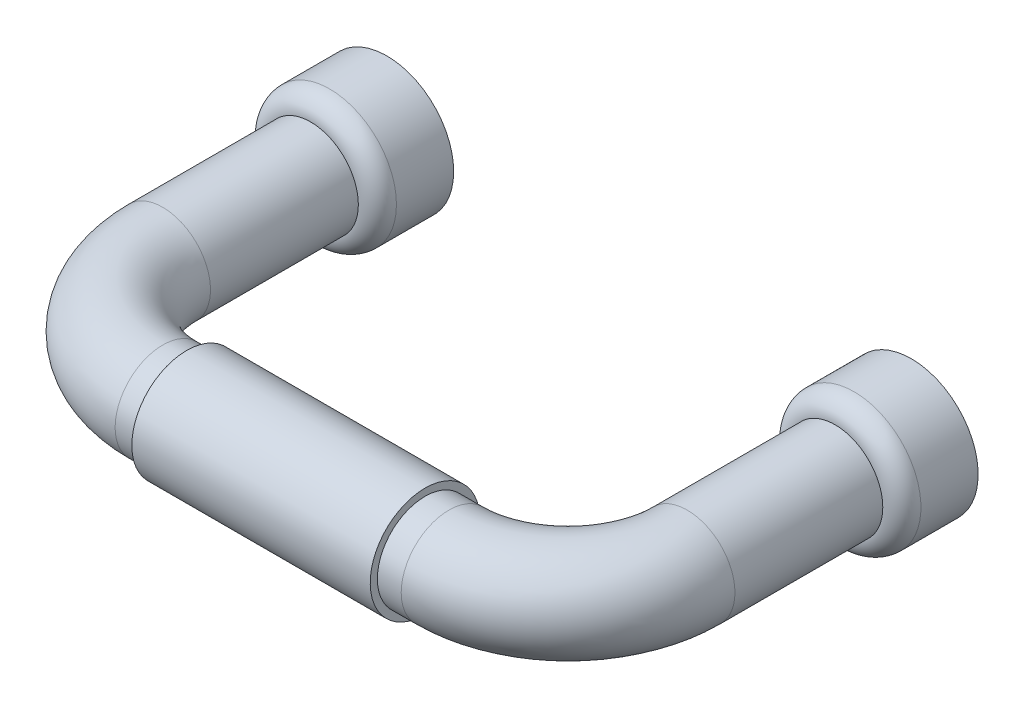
ISO-10303-21;
HEADER;
FILE_DESCRIPTION(('STEP AP214'),'2;1');
FILE_NAME('part.step','',(''),(''),'','','');
FILE_SCHEMA(('AUTOMOTIVE_DESIGN { 1 0 10303 214 1 1 1 1 }'));
ENDSEC;
DATA;
#1=APPLICATION_CONTEXT('core data for automotive mechanical design processes');
#2=APPLICATION_PROTOCOL_DEFINITION('international standard','automotive_design',2000,#1);
#3=PRODUCT_CONTEXT('',#1,'mechanical');
#4=PRODUCT('Part','Part','',(#3));
#5=PRODUCT_RELATED_PRODUCT_CATEGORY('part','',(#4));
#6=PRODUCT_DEFINITION_FORMATION('','',#4);
#7=PRODUCT_DEFINITION_CONTEXT('part definition',#1,'design');
#8=PRODUCT_DEFINITION('design','',#6,#7);
#9=PRODUCT_DEFINITION_SHAPE('','',#8);
#10=(LENGTH_UNIT() NAMED_UNIT(*) SI_UNIT(.MILLI.,.METRE.));
#11=(NAMED_UNIT(*) PLANE_ANGLE_UNIT() SI_UNIT($,.RADIAN.));
#12=(NAMED_UNIT(*) SI_UNIT($,.STERADIAN.) SOLID_ANGLE_UNIT());
#13=UNCERTAINTY_MEASURE_WITH_UNIT(LENGTH_MEASURE(1.E-05),#10,'distance_accuracy_value','');
#14=(GEOMETRIC_REPRESENTATION_CONTEXT(3) GLOBAL_UNCERTAINTY_ASSIGNED_CONTEXT((#13)) GLOBAL_UNIT_ASSIGNED_CONTEXT((#10,
#11,#12)) REPRESENTATION_CONTEXT('',''));
#15=CARTESIAN_POINT('',(0.,0.,0.));
#16=DIRECTION('',(0.,0.,1.));
#17=DIRECTION('',(1.,0.,0.));
#18=AXIS2_PLACEMENT_3D('',#15,#16,#17);
#19=CARTESIAN_POINT('',(-3.15719672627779E-13,0.,7.86972348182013E-13));
#20=DIRECTION('',(0.,0.,-1.));
#21=DIRECTION('',(0.,1.,0.));
#22=AXIS2_PLACEMENT_3D('',#19,#20,#21);
#23=PLANE('',#22);
#24=CARTESIAN_POINT('',(-3.15719672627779E-13,0.,8.15627124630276E-13));
#25=DIRECTION('',(0.,0.,1.));
#26=DIRECTION('',(1.,0.,0.));
#27=AXIS2_PLACEMENT_3D('',#24,#25,#26);
#28=CIRCLE('',#27,7.00045758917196);
#29=CARTESIAN_POINT('',(7.00045758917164,0.,7.88874925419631E-13));
#30=VERTEX_POINT('',#29);
#31=EDGE_CURVE('E295',#30,#30,#28,.T.);
#32=ORIENTED_EDGE('',*,*,#31,.F.);
#33=EDGE_LOOP('',(#32));
#34=FACE_BOUND('',#33,.T.);
#35=CARTESIAN_POINT('',(-3.15719672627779E-13,0.,7.90441795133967E-13));
#36=DIRECTION('',(0.,0.,1.));
#37=DIRECTION('',(0.,-1.,0.));
#38=AXIS2_PLACEMENT_3D('',#35,#36,#37);
#39=CIRCLE('',#38,2.5);
#40=CARTESIAN_POINT('',(-3.15719672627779E-13,-2.5,7.90441795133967E-13));
#41=VERTEX_POINT('',#40);
#42=EDGE_CURVE('E285',#41,#41,#39,.T.);
#43=ORIENTED_EDGE('',*,*,#42,.T.);
#44=EDGE_LOOP('',(#43));
#45=FACE_BOUND('',#44,.T.);
#46=ADVANCED_FACE('F12',(#34,#45),#23,.T.);
#47=CARTESIAN_POINT('',(42.5,0.,36.0000000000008));
#48=DIRECTION('',(-1.,0.,0.));
#49=DIRECTION('',(0.,-1.,0.));
#50=AXIS2_PLACEMENT_3D('',#47,#48,#49);
#51=CYLINDRICAL_SURFACE('',#50,5.);
#52=CARTESIAN_POINT('',(40.,0.,36.0000000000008));
#53=DIRECTION('',(1.,0.,0.));
#54=DIRECTION('',(0.,1.,0.));
#55=AXIS2_PLACEMENT_3D('',#52,#53,#54);
#56=CIRCLE('',#55,5.);
#57=CARTESIAN_POINT('',(40.,5.,36.0000000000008));
#58=VERTEX_POINT('',#57);
#59=EDGE_CURVE('E19',#58,#58,#56,.F.);
#60=ORIENTED_EDGE('',*,*,#59,.F.);
#61=EDGE_LOOP('',(#60));
#62=FACE_BOUND('',#61,.T.);
#63=CARTESIAN_POINT('',(42.5,0.,36.0000000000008));
#64=DIRECTION('',(-1.,0.,0.));
#65=DIRECTION('',(0.,1.,0.));
#66=AXIS2_PLACEMENT_3D('',#63,#64,#65);
#67=CIRCLE('',#66,5.);
#68=CARTESIAN_POINT('',(42.5,0.,41.0000000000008));
#69=VERTEX_POINT('',#68);
#70=EDGE_CURVE('E55',#69,#69,#67,.T.);
#71=ORIENTED_EDGE('',*,*,#70,.T.);
#72=EDGE_LOOP('',(#71));
#73=FACE_BOUND('',#72,.T.);
#74=ADVANCED_FACE('F77',(#62,#73),#51,.T.);
#75=CARTESIAN_POINT('',(42.5,0.,23.5000000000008));
#76=DIRECTION('',(0.,-1.,0.));
#77=DIRECTION('',(1.,0.,0.));
#78=AXIS2_PLACEMENT_3D('',#75,#76,#77);
#79=TOROIDAL_SURFACE('',#78,12.5,5.);
#80=CARTESIAN_POINT('',(55.,0.,23.5000000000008));
#81=DIRECTION('',(0.,0.,1.));
#82=DIRECTION('',(0.,1.,0.));
#83=AXIS2_PLACEMENT_3D('',#80,#81,#82);
#84=CIRCLE('',#83,5.);
#85=CARTESIAN_POINT('',(60.,0.,23.5000000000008));
#86=VERTEX_POINT('',#85);
#87=EDGE_CURVE('E52',#86,#86,#84,.T.);
#88=CARTESIAN_POINT('',(42.5,0.,23.5000000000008));
#89=DIRECTION('',(0.,-1.,0.));
#90=DIRECTION('',(1.,0.,0.));
#91=AXIS2_PLACEMENT_3D('',#88,#89,#90);
#92=CIRCLE('',#91,17.5);
#93=EDGE_CURVE('',#86,#69,#92,.T.);
#94=ORIENTED_EDGE('',*,*,#87,.T.);
#95=ORIENTED_EDGE('',*,*,#70,.F.);
#96=ORIENTED_EDGE('',*,*,#93,.T.);
#97=ORIENTED_EDGE('',*,*,#93,.F.);
#98=EDGE_LOOP('',(#94,#96,#95,#97));
#99=FACE_BOUND('',#98,.T.);
#100=ADVANCED_FACE('F87',(#99),#79,.T.);
#101=CARTESIAN_POINT('',(55.,0.,23.5000000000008));
#102=DIRECTION('',(0.,0.,-1.));
#103=DIRECTION('',(0.,-1.,0.));
#104=AXIS2_PLACEMENT_3D('',#101,#102,#103);
#105=CYLINDRICAL_SURFACE('',#104,5.);
#106=CARTESIAN_POINT('',(55.,0.,7.99921137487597));
#107=DIRECTION('',(0.,0.,1.));
#108=DIRECTION('',(1.,0.,0.));
#109=AXIS2_PLACEMENT_3D('',#106,#107,#108);
#110=CIRCLE('',#109,5.);
#111=CARTESIAN_POINT('',(60.,0.,7.99921137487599));
#112=VERTEX_POINT('',#111);
#113=EDGE_CURVE('E31',#112,#112,#110,.T.);
#114=ORIENTED_EDGE('',*,*,#113,.T.);
#115=EDGE_LOOP('',(#114));
#116=FACE_BOUND('',#115,.T.);
#117=ORIENTED_EDGE('',*,*,#87,.F.);
#118=EDGE_LOOP('',(#117));
#119=FACE_BOUND('',#118,.T.);
#120=ADVANCED_FACE('F95',(#116,#119),#105,.T.);
#121=CARTESIAN_POINT('',(40.,0.,36.0000000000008));
#122=DIRECTION('',(1.,0.,0.));
#123=DIRECTION('',(0.,1.,0.));
#124=AXIS2_PLACEMENT_3D('',#121,#122,#123);
#125=PLANE('',#124);
#126=ORIENTED_EDGE('',*,*,#59,.T.);
#127=EDGE_LOOP('',(#126));
#128=FACE_BOUND('',#127,.T.);
#129=CARTESIAN_POINT('',(40.,0.,36.0000000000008));
#130=DIRECTION('',(1.,0.,0.));
#131=DIRECTION('',(0.,1.,0.));
#132=AXIS2_PLACEMENT_3D('',#129,#130,#131);
#133=CIRCLE('',#132,5.75);
#134=CARTESIAN_POINT('',(40.,5.75,36.0000000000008));
#135=VERTEX_POINT('',#134);
#136=EDGE_CURVE('E33',#135,#135,#133,.T.);
#137=ORIENTED_EDGE('',*,*,#136,.T.);
#138=EDGE_LOOP('',(#137));
#139=FACE_BOUND('',#138,.T.);
#140=ADVANCED_FACE('F98',(#128,#139),#125,.T.);
#141=CARTESIAN_POINT('',(14.9999999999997,0.,41.7500000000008));
#142=DIRECTION('',(-1.,0.,0.));
#143=DIRECTION('',(0.,-1.,0.));
#144=AXIS2_PLACEMENT_3D('',#141,#142,#143);
#145=PLANE('',#144);
#146=CARTESIAN_POINT('',(14.9999999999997,0.,36.0000000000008));
#147=DIRECTION('',(-1.,0.,0.));
#148=DIRECTION('',(0.,-1.,0.));
#149=AXIS2_PLACEMENT_3D('',#146,#147,#148);
#150=CIRCLE('',#149,5.);
#151=CARTESIAN_POINT('',(14.9999999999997,-5.,36.0000000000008));
#152=VERTEX_POINT('',#151);
#153=EDGE_CURVE('E23',#152,#152,#150,.F.);
#154=ORIENTED_EDGE('',*,*,#153,.T.);
#155=EDGE_LOOP('',(#154));
#156=FACE_BOUND('',#155,.T.);
#157=CARTESIAN_POINT('',(14.9999999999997,0.,36.0000000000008));
#158=DIRECTION('',(1.,0.,0.));
#159=DIRECTION('',(0.,1.,0.));
#160=AXIS2_PLACEMENT_3D('',#157,#158,#159);
#161=CIRCLE('',#160,5.75);
#162=CARTESIAN_POINT('',(14.9999999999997,5.75,36.0000000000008));
#163=VERTEX_POINT('',#162);
#164=EDGE_CURVE('E38',#163,#163,#161,.T.);
#165=ORIENTED_EDGE('',*,*,#164,.F.);
#166=EDGE_LOOP('',(#165));
#167=FACE_BOUND('',#166,.T.);
#168=ADVANCED_FACE('F127',(#156,#167),#145,.T.);
#169=CARTESIAN_POINT('',(43.3852693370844,0.,36.0000000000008));
#170=DIRECTION('',(1.,0.,0.));
#171=DIRECTION('',(0.,1.,0.));
#172=AXIS2_PLACEMENT_3D('',#169,#170,#171);
#173=CYLINDRICAL_SURFACE('',#172,5.75);
#174=ORIENTED_EDGE('',*,*,#136,.F.);
#175=EDGE_LOOP('',(#174));
#176=FACE_BOUND('',#175,.T.);
#177=ORIENTED_EDGE('',*,*,#164,.T.);
#178=EDGE_LOOP('',(#177));
#179=FACE_BOUND('',#178,.T.);
#180=ADVANCED_FACE('F78',(#176,#179),#173,.T.);
#181=CARTESIAN_POINT('',(-3.08780778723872E-13,0.,23.5000000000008));
#182=DIRECTION('',(0.,0.,-1.));
#183=DIRECTION('',(-1.,0.,0.));
#184=AXIS2_PLACEMENT_3D('',#181,#182,#183);
#185=CYLINDRICAL_SURFACE('',#184,5.);
#186=CARTESIAN_POINT('',(-3.12250225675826E-13,0.,7.99921137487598));
#187=DIRECTION('',(0.,0.,1.));
#188=DIRECTION('',(1.,0.,0.));
#189=AXIS2_PLACEMENT_3D('',#186,#187,#188);
#190=CIRCLE('',#189,5.);
#191=CARTESIAN_POINT('',(4.99999999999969,0.,7.99921137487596));
#192=VERTEX_POINT('',#191);
#193=EDGE_CURVE('E8',#192,#192,#190,.F.);
#194=ORIENTED_EDGE('',*,*,#193,.F.);
#195=EDGE_LOOP('',(#194));
#196=FACE_BOUND('',#195,.T.);
#197=CARTESIAN_POINT('',(-3.08780778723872E-13,0.,23.5000000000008));
#198=DIRECTION('',(0.,0.,-1.));
#199=DIRECTION('',(0.,1.,0.));
#200=AXIS2_PLACEMENT_3D('',#197,#198,#199);
#201=CIRCLE('',#200,5.);
#202=CARTESIAN_POINT('',(-5.0000000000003,0.,23.5000000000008));
#203=VERTEX_POINT('',#202);
#204=EDGE_CURVE('E28',#203,#203,#201,.T.);
#205=ORIENTED_EDGE('',*,*,#204,.T.);
#206=EDGE_LOOP('',(#205));
#207=FACE_BOUND('',#206,.T.);
#208=ADVANCED_FACE('F14',(#196,#207),#185,.T.);
#209=CARTESIAN_POINT('',(12.4999999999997,0.,23.5000000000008));
#210=DIRECTION('',(0.,-1.,0.));
#211=DIRECTION('',(1.,0.,0.));
#212=AXIS2_PLACEMENT_3D('',#209,#210,#211);
#213=TOROIDAL_SURFACE('',#212,12.5,5.);
#214=CARTESIAN_POINT('',(12.4999999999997,0.,36.0000000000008));
#215=DIRECTION('',(-1.,0.,0.));
#216=DIRECTION('',(0.,1.,0.));
#217=AXIS2_PLACEMENT_3D('',#214,#215,#216);
#218=CIRCLE('',#217,5.);
#219=CARTESIAN_POINT('',(12.4999999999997,0.,41.0000000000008));
#220=VERTEX_POINT('',#219);
#221=EDGE_CURVE('E58',#220,#220,#218,.T.);
#222=CARTESIAN_POINT('',(12.4999999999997,0.,23.5000000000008));
#223=DIRECTION('',(0.,-1.,0.));
#224=DIRECTION('',(1.,0.,0.));
#225=AXIS2_PLACEMENT_3D('',#222,#223,#224);
#226=CIRCLE('',#225,17.5);
#227=EDGE_CURVE('',#220,#203,#226,.T.);
#228=ORIENTED_EDGE('',*,*,#221,.T.);
#229=ORIENTED_EDGE('',*,*,#204,.F.);
#230=ORIENTED_EDGE('',*,*,#227,.T.);
#231=ORIENTED_EDGE('',*,*,#227,.F.);
#232=EDGE_LOOP('',(#228,#230,#229,#231));
#233=FACE_BOUND('',#232,.T.);
#234=ADVANCED_FACE('F64',(#233),#213,.T.);
#235=ORIENTED_EDGE('',*,*,#153,.F.);
#236=EDGE_LOOP('',(#235));
#237=FACE_BOUND('',#236,.T.);
#238=ORIENTED_EDGE('',*,*,#221,.F.);
#239=EDGE_LOOP('',(#238));
#240=FACE_BOUND('',#239,.T.);
#241=ADVANCED_FACE('F66',(#237,#240),#51,.T.);
#242=CARTESIAN_POINT('',(49.9995424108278,0.,7.99921137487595));
#243=DIRECTION('',(0.,0.,1.));
#244=DIRECTION('',(1.,0.,0.));
#245=AXIS2_PLACEMENT_3D('',#242,#243,#244);
#246=PLANE('',#245);
#247=CARTESIAN_POINT('',(55.,0.,7.99921137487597));
#248=DIRECTION('',(0.,0.,-1.));
#249=DIRECTION('',(-1.,0.,0.));
#250=AXIS2_PLACEMENT_3D('',#247,#248,#249);
#251=CIRCLE('',#250,5.00045758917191);
#252=CARTESIAN_POINT('',(49.9995424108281,0.,7.99921137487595));
#253=VERTEX_POINT('',#252);
#254=EDGE_CURVE('E46',#253,#253,#251,.T.);
#255=ORIENTED_EDGE('',*,*,#254,.F.);
#256=EDGE_LOOP('',(#255));
#257=FACE_BOUND('',#256,.T.);
#258=ORIENTED_EDGE('',*,*,#113,.F.);
#259=EDGE_LOOP('',(#258));
#260=FACE_BOUND('',#259,.T.);
#261=ADVANCED_FACE('F74',(#257,#260),#246,.T.);
#262=CARTESIAN_POINT('',(55.,0.,7.78131480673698E-13));
#263=DIRECTION('',(0.,0.,-1.));
#264=DIRECTION('',(-1.,0.,0.));
#265=AXIS2_PLACEMENT_3D('',#262,#263,#264);
#266=CYLINDRICAL_SURFACE('',#265,7.00045758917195);
#267=CARTESIAN_POINT('',(55.,0.,5.99921137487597));
#268=DIRECTION('',(0.,0.,-1.));
#269=DIRECTION('',(-1.,0.,0.));
#270=AXIS2_PLACEMENT_3D('',#267,#268,#269);
#271=CIRCLE('',#270,7.00045758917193);
#272=CARTESIAN_POINT('',(47.9995424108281,0.,5.99921137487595));
#273=VERTEX_POINT('',#272);
#274=EDGE_CURVE('E41',#273,#273,#271,.T.);
#275=ORIENTED_EDGE('',*,*,#274,.T.);
#276=EDGE_LOOP('',(#275));
#277=FACE_BOUND('',#276,.T.);
#278=CARTESIAN_POINT('',(55.,0.,8.03316810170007E-13));
#279=DIRECTION('',(0.,0.,-1.));
#280=DIRECTION('',(-1.,0.,0.));
#281=AXIS2_PLACEMENT_3D('',#278,#279,#280);
#282=CIRCLE('',#281,7.00045758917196);
#283=CARTESIAN_POINT('',(47.999542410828,0.,7.79698350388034E-13));
#284=VERTEX_POINT('',#283);
#285=EDGE_CURVE('E34',#284,#284,#282,.T.);
#286=ORIENTED_EDGE('',*,*,#285,.F.);
#287=EDGE_LOOP('',(#286));
#288=FACE_BOUND('',#287,.T.);
#289=ADVANCED_FACE('F181',(#277,#288),#266,.T.);
#290=CARTESIAN_POINT('',(55.,0.,5.99921137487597));
#291=DIRECTION('',(0.,0.,-1.));
#292=DIRECTION('',(-1.,0.,0.));
#293=AXIS2_PLACEMENT_3D('',#290,#291,#292);
#294=TOROIDAL_SURFACE('',#293,5.00045758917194,2.);
#295=ORIENTED_EDGE('',*,*,#254,.T.);
#296=EDGE_LOOP('',(#295));
#297=FACE_BOUND('',#296,.T.);
#298=ORIENTED_EDGE('',*,*,#274,.F.);
#299=EDGE_LOOP('',(#298));
#300=FACE_BOUND('',#299,.T.);
#301=ADVANCED_FACE('F189',(#297,#300),#294,.T.);
#302=CARTESIAN_POINT('',(55.,0.,7.78131480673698E-13));
#303=DIRECTION('',(0.,0.,1.));
#304=DIRECTION('',(0.,1.,0.));
#305=AXIS2_PLACEMENT_3D('',#302,#303,#304);
#306=PLANE('',#305);
#307=CARTESIAN_POINT('',(55.,0.,7.78131480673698E-13));
#308=DIRECTION('',(0.,0.,-1.));
#309=DIRECTION('',(0.,-1.,0.));
#310=AXIS2_PLACEMENT_3D('',#307,#308,#309);
#311=CIRCLE('',#310,2.5);
#312=CARTESIAN_POINT('',(55.,-2.5,7.78131480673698E-13));
#313=VERTEX_POINT('',#312);
#314=EDGE_CURVE('E298',#313,#313,#311,.T.);
#315=ORIENTED_EDGE('',*,*,#314,.F.);
#316=EDGE_LOOP('',(#315));
#317=FACE_BOUND('',#316,.T.);
#318=ORIENTED_EDGE('',*,*,#285,.T.);
#319=EDGE_LOOP('',(#318));
#320=FACE_BOUND('',#319,.T.);
#321=ADVANCED_FACE('F93',(#317,#320),#306,.F.);
#322=CARTESIAN_POINT('',(55.,0.,11.0000000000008));
#323=DIRECTION('',(0.,0.,-1.));
#324=DIRECTION('',(0.,-1.,0.));
#325=AXIS2_PLACEMENT_3D('',#322,#323,#324);
#326=CYLINDRICAL_SURFACE('',#325,2.5);
#327=CARTESIAN_POINT('',(55.,0.,11.0000000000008));
#328=DIRECTION('',(0.,0.,-1.));
#329=DIRECTION('',(0.,-1.,0.));
#330=AXIS2_PLACEMENT_3D('',#327,#328,#329);
#331=CIRCLE('',#330,2.5);
#332=CARTESIAN_POINT('',(55.,-2.5,11.0000000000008));
#333=VERTEX_POINT('',#332);
#334=EDGE_CURVE('E301',#333,#333,#331,.T.);
#335=ORIENTED_EDGE('',*,*,#334,.F.);
#336=EDGE_LOOP('',(#335));
#337=FACE_BOUND('',#336,.T.);
#338=ORIENTED_EDGE('',*,*,#314,.T.);
#339=EDGE_LOOP('',(#338));
#340=FACE_BOUND('',#339,.T.);
#341=ADVANCED_FACE('F206',(#337,#340),#326,.F.);
#342=CARTESIAN_POINT('',(55.,0.,11.0000000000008));
#343=DIRECTION('',(0.,0.,-1.));
#344=DIRECTION('',(0.,-1.,0.));
#345=AXIS2_PLACEMENT_3D('',#342,#343,#344);
#346=PLANE('',#345);
#347=ORIENTED_EDGE('',*,*,#334,.T.);
#348=EDGE_LOOP('',(#347));
#349=FACE_BOUND('',#348,.T.);
#350=ADVANCED_FACE('F208',(#349),#346,.T.);
#351=CARTESIAN_POINT('',(-3.15719672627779E-13,0.,7.90441795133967E-13));
#352=DIRECTION('',(0.,0.,-1.));
#353=DIRECTION('',(1.,0.,0.));
#354=AXIS2_PLACEMENT_3D('',#351,#352,#353);
#355=CYLINDRICAL_SURFACE('',#354,7.00045758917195);
#356=CARTESIAN_POINT('',(-3.15719672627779E-13,0.,5.99921137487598));
#357=DIRECTION('',(0.,0.,1.));
#358=DIRECTION('',(1.,0.,0.));
#359=AXIS2_PLACEMENT_3D('',#356,#357,#358);
#360=CIRCLE('',#359,7.00045758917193);
#361=CARTESIAN_POINT('',(7.00045758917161,0.,5.99921137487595));
#362=VERTEX_POINT('',#361);
#363=EDGE_CURVE('E288',#362,#362,#360,.T.);
#364=ORIENTED_EDGE('',*,*,#363,.F.);
#365=EDGE_LOOP('',(#364));
#366=FACE_BOUND('',#365,.T.);
#367=ORIENTED_EDGE('',*,*,#31,.T.);
#368=EDGE_LOOP('',(#367));
#369=FACE_BOUND('',#368,.T.);
#370=ADVANCED_FACE('F217',(#366,#369),#355,.T.);
#371=CARTESIAN_POINT('',(-3.15719672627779E-13,0.,5.99921137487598));
#372=DIRECTION('',(0.,0.,-1.));
#373=DIRECTION('',(1.,0.,0.));
#374=AXIS2_PLACEMENT_3D('',#371,#372,#373);
#375=TOROIDAL_SURFACE('',#374,5.00045758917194,2.);
#376=CARTESIAN_POINT('',(-3.12250225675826E-13,0.,7.99921137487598));
#377=DIRECTION('',(0.,0.,1.));
#378=DIRECTION('',(1.,0.,0.));
#379=AXIS2_PLACEMENT_3D('',#376,#377,#378);
#380=CIRCLE('',#379,5.00045758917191);
#381=CARTESIAN_POINT('',(5.0004575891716,0.,7.99921137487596));
#382=VERTEX_POINT('',#381);
#383=EDGE_CURVE('E284',#382,#382,#380,.T.);
#384=ORIENTED_EDGE('',*,*,#383,.F.);
#385=EDGE_LOOP('',(#384));
#386=FACE_BOUND('',#385,.T.);
#387=ORIENTED_EDGE('',*,*,#363,.T.);
#388=EDGE_LOOP('',(#387));
#389=FACE_BOUND('',#388,.T.);
#390=ADVANCED_FACE('F232',(#386,#389),#375,.T.);
#391=CARTESIAN_POINT('',(5.00045758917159,0.,7.99921137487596));
#392=DIRECTION('',(0.,0.,1.));
#393=DIRECTION('',(-1.,0.,0.));
#394=AXIS2_PLACEMENT_3D('',#391,#392,#393);
#395=PLANE('',#394);
#396=ORIENTED_EDGE('',*,*,#193,.T.);
#397=EDGE_LOOP('',(#396));
#398=FACE_BOUND('',#397,.T.);
#399=ORIENTED_EDGE('',*,*,#383,.T.);
#400=EDGE_LOOP('',(#399));
#401=FACE_BOUND('',#400,.T.);
#402=ADVANCED_FACE('F241',(#398,#401),#395,.T.);
#403=CARTESIAN_POINT('',(-3.12250225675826E-13,0.,11.0000000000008));
#404=DIRECTION('',(0.,0.,-1.));
#405=DIRECTION('',(0.,-1.,0.));
#406=AXIS2_PLACEMENT_3D('',#403,#404,#405);
#407=CYLINDRICAL_SURFACE('',#406,2.5);
#408=CARTESIAN_POINT('',(-3.12250225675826E-13,0.,11.0000000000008));
#409=DIRECTION('',(0.,0.,1.));
#410=DIRECTION('',(0.,-1.,0.));
#411=AXIS2_PLACEMENT_3D('',#408,#409,#410);
#412=CIRCLE('',#411,2.5);
#413=CARTESIAN_POINT('',(-3.12250225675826E-13,-2.5,11.0000000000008));
#414=VERTEX_POINT('',#413);
#415=EDGE_CURVE('E283',#414,#414,#412,.T.);
#416=ORIENTED_EDGE('',*,*,#415,.T.);
#417=EDGE_LOOP('',(#416));
#418=FACE_BOUND('',#417,.T.);
#419=ORIENTED_EDGE('',*,*,#42,.F.);
#420=EDGE_LOOP('',(#419));
#421=FACE_BOUND('',#420,.T.);
#422=ADVANCED_FACE('F250',(#418,#421),#407,.F.);
#423=CARTESIAN_POINT('',(-3.12250225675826E-13,0.,11.0000000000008));
#424=DIRECTION('',(0.,0.,-1.));
#425=DIRECTION('',(0.,-1.,0.));
#426=AXIS2_PLACEMENT_3D('',#423,#424,#425);
#427=PLANE('',#426);
#428=ORIENTED_EDGE('',*,*,#415,.F.);
#429=EDGE_LOOP('',(#428));
#430=FACE_BOUND('',#429,.T.);
#431=ADVANCED_FACE('F252',(#430),#427,.T.);
#432=CLOSED_SHELL('',(#46,#74,#100,#120,#140,#168,#180,#208,#234,#241,#261,#289,#301,#321,#341,
#350,#370,#390,#402,#422,#431));
#433=MANIFOLD_SOLID_BREP('B1',#432);
#434=ADVANCED_BREP_SHAPE_REPRESENTATION('',(#18,#433),#14);
#435=SHAPE_DEFINITION_REPRESENTATION(#9,#434);
ENDSEC;
END-ISO-10303-21;
